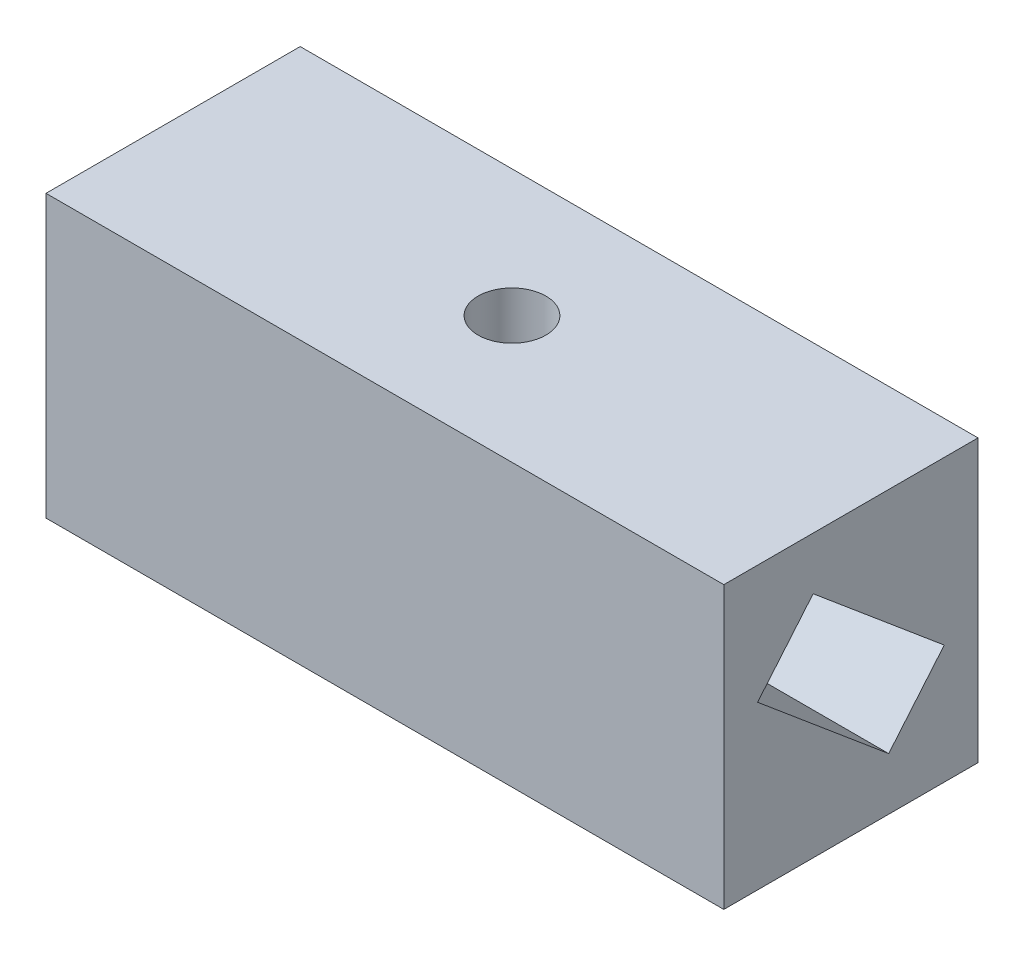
from build123d import *

# Parameters (mm, degrees)
SKETCH_1_W          = 80
SKETCH_1_H          = 30
EXTRUDE_1_DEPTH     = 33.2
SKETCH_2_R          = 4
CUT_EXTRUDE_1_DEPTH = 55.103973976
CUT_EXTRUDE_4_DEPTH = 30
CUT_EXTRUDE_5_DEPTH = 30


with BuildPart() as part:
    # Sketch 1 → Extrude 1 (new body)
    with BuildSketch(Plane(origin=(0, 0, 0), x_dir=(1, 0, 0), z_dir=(0, 1, 0))):
        Rectangle(SKETCH_1_W, SKETCH_1_H)
    extrude(amount=EXTRUDE_1_DEPTH)

    # Sketch 2 → Cut-Extrude 1 (cut, through all)
    with BuildSketch(Plane(origin=(0, 33.2, 0), x_dir=(1, 0, 0), z_dir=(0, 1, 0))):
        with Locations(Location((0, 0, 0), (0, 0, 270))):
            Circle(SKETCH_2_R)
    extrude(amount=-CUT_EXTRUDE_1_DEPTH, mode=Mode.SUBTRACT)

    # Sketch 5 → Cut-Extrude 4 (cut)
    with BuildSketch(Plane.ZY.offset(40)):
        Polygon((-11.015265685, 14.014671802), (-4.458832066, 6.201018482), (11.015265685, 19.185328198), (4.458832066, 26.998981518), align=None)
    extrude(amount=-CUT_EXTRUDE_4_DEPTH, mode=Mode.SUBTRACT)

    # Sketch 6 → Cut-Extrude 5 (cut)
    with BuildSketch(Plane(origin=(40, 0, 0), x_dir=(0, 0, -1), z_dir=(1, 0, 0))):
        Polygon((11.015265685, 14.014671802), (4.458832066, 6.201018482), (-11.015265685, 19.185328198), (-4.458832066, 26.998981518), align=None)
    extrude(amount=-CUT_EXTRUDE_5_DEPTH, mode=Mode.SUBTRACT)


solid = part.part
